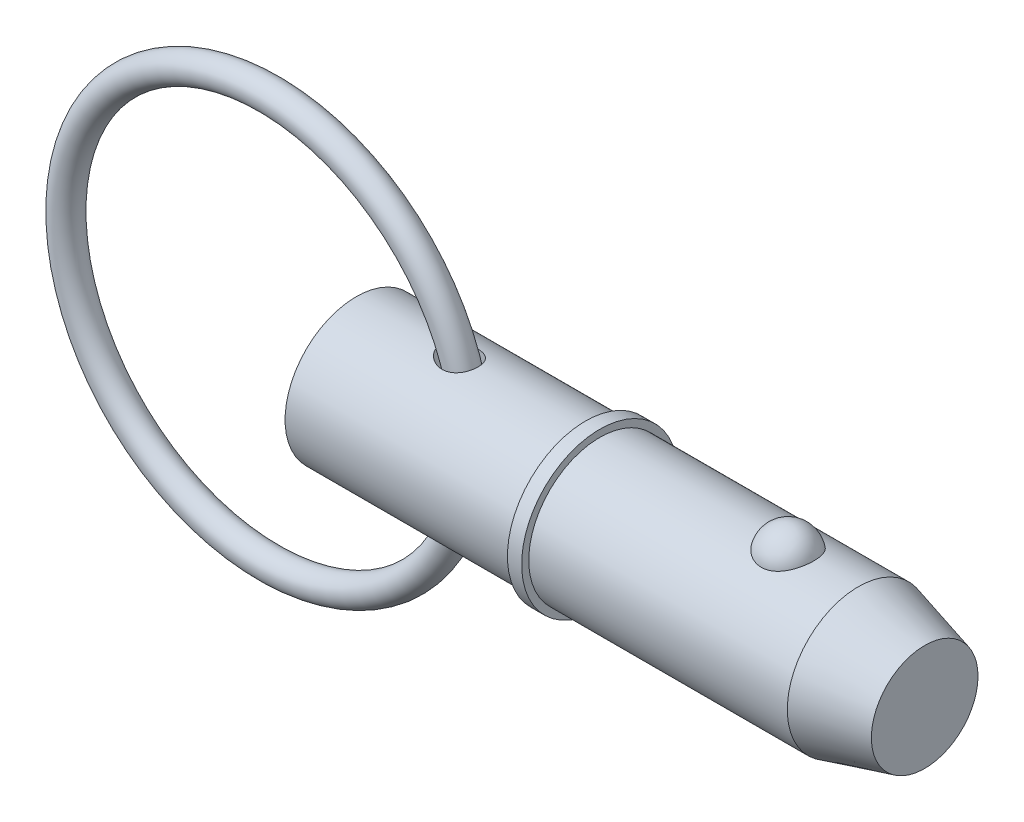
ISO-10303-21;
HEADER;
FILE_DESCRIPTION(('STEP AP214'),'2;1');
FILE_NAME('part.step','',(''),(''),'','','');
FILE_SCHEMA(('AUTOMOTIVE_DESIGN { 1 0 10303 214 1 1 1 1 }'));
ENDSEC;
DATA;
#1=APPLICATION_CONTEXT('core data for automotive mechanical design processes');
#2=APPLICATION_PROTOCOL_DEFINITION('international standard','automotive_design',2000,#1);
#3=PRODUCT_CONTEXT('',#1,'mechanical');
#4=PRODUCT('Part','Part','',(#3));
#5=PRODUCT_RELATED_PRODUCT_CATEGORY('part','',(#4));
#6=PRODUCT_DEFINITION_FORMATION('','',#4);
#7=PRODUCT_DEFINITION_CONTEXT('part definition',#1,'design');
#8=PRODUCT_DEFINITION('design','',#6,#7);
#9=PRODUCT_DEFINITION_SHAPE('','',#8);
#10=(LENGTH_UNIT() NAMED_UNIT(*) SI_UNIT(.MILLI.,.METRE.));
#11=(NAMED_UNIT(*) PLANE_ANGLE_UNIT() SI_UNIT($,.RADIAN.));
#12=(NAMED_UNIT(*) SI_UNIT($,.STERADIAN.) SOLID_ANGLE_UNIT());
#13=UNCERTAINTY_MEASURE_WITH_UNIT(LENGTH_MEASURE(1.E-05),#10,'distance_accuracy_value','');
#14=(GEOMETRIC_REPRESENTATION_CONTEXT(3) GLOBAL_UNCERTAINTY_ASSIGNED_CONTEXT((#13)) GLOBAL_UNIT_ASSIGNED_CONTEXT((#10,
#11,#12)) REPRESENTATION_CONTEXT('',''));
#15=CARTESIAN_POINT('',(0.,0.,0.));
#16=DIRECTION('',(0.,0.,1.));
#17=DIRECTION('',(1.,0.,0.));
#18=AXIS2_PLACEMENT_3D('',#15,#16,#17);
#19=CARTESIAN_POINT('',(-13.640845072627,0.,0.));
#20=DIRECTION('',(0.,0.,1.));
#21=DIRECTION('',(1.,0.,0.));
#22=AXIS2_PLACEMENT_3D('',#19,#20,#21);
#23=TOROIDAL_SURFACE('',#22,31.75,2.223);
#24=CARTESIAN_POINT('',(20.332154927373,0.,0.));
#25=VERTEX_POINT('',#24);
#26=VERTEX_LOOP('',#25);
#27=FACE_BOUND('',#26,.T.);
#28=ADVANCED_FACE('P0_F12',(#27),#23,.T.);
#29=CLOSED_SHELL('',(#28));
#30=MANIFOLD_SOLID_BREP('P0_B1',#29);
#31=CARTESIAN_POINT('',(0.,0.,0.));
#32=DIRECTION('',(1.,0.,0.));
#33=DIRECTION('',(0.,0.,-1.));
#34=AXIS2_PLACEMENT_3D('',#31,#32,#33);
#35=CYLINDRICAL_SURFACE('',#34,11.115);
#36=CARTESIAN_POINT('',(13.5245830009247,11.0328953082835,-1.34849772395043));
#37=CARTESIAN_POINT('',(13.6190616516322,11.0150940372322,-1.49413162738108));
#38=CARTESIAN_POINT('',(13.7272589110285,10.9954577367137,-1.63076546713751));
#39=CARTESIAN_POINT('',(13.9654537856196,10.9550099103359,-1.8834727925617));
#40=CARTESIAN_POINT('',(14.0954990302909,10.9341958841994,-1.99950019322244));
#41=CARTESIAN_POINT('',(14.3718600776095,10.893854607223,-2.20871939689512));
#42=CARTESIAN_POINT('',(14.5180879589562,10.8743212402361,-2.30202655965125));
#43=CARTESIAN_POINT('',(14.8233821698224,10.8385071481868,-2.46515115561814));
#44=CARTESIAN_POINT('',(14.9824448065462,10.8222254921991,-2.53497531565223));
#45=CARTESIAN_POINT('',(15.3233581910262,10.7936101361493,-2.65430007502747));
#46=CARTESIAN_POINT('',(15.5060064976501,10.7817126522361,-2.7016502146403));
#47=CARTESIAN_POINT('',(15.8771124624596,10.7657570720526,-2.76455948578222));
#48=CARTESIAN_POINT('',(16.0655695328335,10.7616981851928,-2.78012182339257));
#49=CARTESIAN_POINT('',(16.4345152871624,10.7624400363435,-2.77724928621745));
#50=CARTESIAN_POINT('',(16.6150121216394,10.7668823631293,-2.76018977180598));
#51=CARTESIAN_POINT('',(16.9695132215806,10.7837407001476,-2.69357457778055));
#52=CARTESIAN_POINT('',(17.1435222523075,10.7961507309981,-2.64404326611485));
#53=CARTESIAN_POINT('',(17.4621418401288,10.8258984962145,-2.51928348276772));
#54=CARTESIAN_POINT('',(17.6079677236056,10.8426430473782,-2.44700611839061));
#55=CARTESIAN_POINT('',(17.884162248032,10.8794194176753,-2.27791740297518));
#56=CARTESIAN_POINT('',(18.0145349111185,10.8994503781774,-2.18111245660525));
#57=CARTESIAN_POINT('',(18.2494965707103,10.9392822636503,-1.9713196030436));
#58=CARTESIAN_POINT('',(18.3550661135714,10.9590421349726,-1.85941863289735));
#59=CARTESIAN_POINT('',(18.5458147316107,10.9970986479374,-1.61919918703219));
#60=CARTESIAN_POINT('',(18.6309947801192,11.0153953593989,-1.49088149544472));
#61=CARTESIAN_POINT('',(18.7786686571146,11.0484675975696,-1.2218388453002));
#62=CARTESIAN_POINT('',(18.8412214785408,11.063252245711,-1.08114735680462));
#63=CARTESIAN_POINT('',(18.9425265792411,11.0877718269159,-0.791025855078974));
#64=CARTESIAN_POINT('',(18.9812780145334,11.0975065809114,-0.641595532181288));
#65=CARTESIAN_POINT('',(19.0343305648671,11.1109435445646,-0.336997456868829));
#66=CARTESIAN_POINT('',(19.0484404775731,11.1145985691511,-0.181794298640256));
#67=CARTESIAN_POINT('',(19.0513147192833,11.1153384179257,0.1288646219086));
#68=CARTESIAN_POINT('',(19.0400783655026,11.112423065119,0.284320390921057));
#69=CARTESIAN_POINT('',(18.9924362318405,11.1003163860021,0.591525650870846));
#70=CARTESIAN_POINT('',(18.9559600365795,11.0911075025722,0.743263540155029));
#71=CARTESIAN_POINT('',(18.858576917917,11.0673920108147,1.03825247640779));
#72=CARTESIAN_POINT('',(18.7976699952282,11.0528854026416,1.18150352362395));
#73=CARTESIAN_POINT('',(18.6529960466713,11.020201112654,1.45511394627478));
#74=CARTESIAN_POINT('',(18.5692772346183,11.0020311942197,1.58549973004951));
#75=CARTESIAN_POINT('',(18.3810003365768,10.9640237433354,1.82995492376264));
#76=CARTESIAN_POINT('',(18.2764441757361,10.9441863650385,1.9440258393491));
#77=CARTESIAN_POINT('',(18.0501398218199,10.9052267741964,2.15183128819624));
#78=CARTESIAN_POINT('',(17.9285270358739,10.8861003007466,2.24571250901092));
#79=CARTESIAN_POINT('',(17.6709592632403,10.8505244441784,2.41175942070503));
#80=CARTESIAN_POINT('',(17.5350055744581,10.8340748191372,2.48392707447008));
#81=CARTESIAN_POINT('',(17.2528390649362,10.8056099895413,2.60497667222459));
#82=CARTESIAN_POINT('',(17.1066353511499,10.7935909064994,2.65387899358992));
#83=CARTESIAN_POINT('',(16.8080326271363,10.7750969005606,2.72799859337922));
#84=CARTESIAN_POINT('',(16.6556326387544,10.7686228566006,2.75321211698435));
#85=CARTESIAN_POINT('',(16.3428877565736,10.761517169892,2.78086153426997));
#86=CARTESIAN_POINT('',(16.1824599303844,10.7611149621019,2.78240297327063));
#87=CARTESIAN_POINT('',(15.863296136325,10.766478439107,2.76156874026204));
#88=CARTESIAN_POINT('',(15.7045607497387,10.7722461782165,2.73918510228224));
#89=CARTESIAN_POINT('',(15.3787211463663,10.7898500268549,2.66904167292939));
#90=CARTESIAN_POINT('',(15.2120794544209,10.8021675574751,2.6192557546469));
#91=CARTESIAN_POINT('',(14.8886284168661,10.8315482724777,2.4949635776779));
#92=CARTESIAN_POINT('',(14.731827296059,10.8486153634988,2.42043695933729));
#93=CARTESIAN_POINT('',(14.4198762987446,10.8870804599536,2.24137362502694));
#94=CARTESIAN_POINT('',(14.2658484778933,10.9087148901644,2.13492229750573));
#95=CARTESIAN_POINT('',(13.9788214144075,10.9526299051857,1.89676517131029));
#96=CARTESIAN_POINT('',(13.845804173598,10.9749099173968,1.76508120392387));
#97=CARTESIAN_POINT('',(13.6310853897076,11.012885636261,1.50762337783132));
#98=CARTESIAN_POINT('',(13.5444453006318,11.0290026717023,1.38602082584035));
#99=CARTESIAN_POINT('',(13.392158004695,11.0581740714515,1.12983363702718));
#100=CARTESIAN_POINT('',(13.3264946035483,11.0712307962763,0.995259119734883));
#101=CARTESIAN_POINT('',(13.2464179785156,11.0874250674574,0.785640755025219));
#102=CARTESIAN_POINT('',(13.2227369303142,11.0922707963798,0.71416661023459));
#103=CARTESIAN_POINT('',(13.1820656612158,11.1006486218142,0.56927708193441));
#104=CARTESIAN_POINT('',(13.1650721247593,11.1041813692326,0.495862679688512));
#105=CARTESIAN_POINT('',(13.1381118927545,11.1098070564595,0.34771199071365));
#106=CARTESIAN_POINT('',(13.1281436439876,11.1119003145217,0.272975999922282));
#107=CARTESIAN_POINT('',(13.1154243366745,11.1145746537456,0.122890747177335));
#108=CARTESIAN_POINT('',(13.1126723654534,11.1151559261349,0.0475415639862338));
#109=CARTESIAN_POINT('',(13.1151602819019,11.1146296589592,-0.160384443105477));
#110=CARTESIAN_POINT('',(13.128061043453,11.111903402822,-0.292944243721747));
#111=CARTESIAN_POINT('',(13.175691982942,11.1019662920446,-0.553751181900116));
#112=CARTESIAN_POINT('',(13.2104121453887,11.094757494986,-0.682000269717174));
#113=CARTESIAN_POINT('',(13.2891255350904,11.0787645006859,-0.901873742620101));
#114=CARTESIAN_POINT('',(13.3290466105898,11.0707438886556,-0.995044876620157));
#115=CARTESIAN_POINT('',(13.4192915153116,11.0529876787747,-1.175992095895));
#116=CARTESIAN_POINT('',(13.4696154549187,11.0432520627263,-1.26376812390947));
#117=CARTESIAN_POINT('',(13.5245830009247,11.0328953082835,-1.34849772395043));
#118=B_SPLINE_CURVE_WITH_KNOTS('',3,(#36,#37,#38,#39,#40,#41,#42,#43,#44,#45,#46,#47,#48,#49,
#50,#51,#52,#53,#54,#55,#56,#57,#58,#59,#60,#61,#62,#63,#64,#65,#66,#67,#68,#69,#70,#71,#72,#73,
#74,#75,#76,#77,#78,#79,#80,#81,#82,#83,#84,#85,#86,#87,#88,#89,#90,#91,#92,#93,#94,#95,#96,#97,
#98,#99,#100,#101,#102,#103,#104,#105,#106,#107,#108,#109,#110,#111,#112,#113,#114,#115,#116,
#117),.UNSPECIFIED.,.T.,.F.,(4,2,2,2,2,2,2,2,2,2,2,2,2,2,2,2,2,2,2,2,2,2,2,2,2,2,2,2,2,2,2,2,2,
2,2,2,2,2,2,2,4),(0.,0.523099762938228,1.04735506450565,1.5688902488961,2.09027590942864,
2.65465173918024,3.21897064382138,3.76002078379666,4.30066536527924,4.78898318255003,
5.27717362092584,5.74028268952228,6.20336964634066,6.66524040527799,7.12712754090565,
7.59258295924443,8.05805091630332,8.52482272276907,8.99159451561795,9.45738731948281,
9.92313710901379,10.3853792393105,10.8475795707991,11.3093743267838,11.771242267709,
12.2505208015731,12.7299589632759,13.2508366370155,13.7721440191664,14.334890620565,
14.8971525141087,15.3459336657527,15.7943675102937,16.0204422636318,16.2464047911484,
16.4723173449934,16.6982013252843,17.095711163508,17.4930386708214,17.7973741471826,
18.1017128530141),.UNSPECIFIED.);
#119=CARTESIAN_POINT('',(13.5245830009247,11.0328953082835,-1.34849772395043));
#120=VERTEX_POINT('',#119);
#121=EDGE_CURVE('P1_E42',#120,#120,#118,.T.);
#122=ORIENTED_EDGE('',*,*,#121,.T.);
#123=EDGE_LOOP('',(#122));
#124=FACE_BOUND('',#123,.T.);
#125=CARTESIAN_POINT('',(0.,0.,0.));
#126=DIRECTION('',(1.,0.,0.));
#127=DIRECTION('',(0.,0.,-1.));
#128=AXIS2_PLACEMENT_3D('',#125,#126,#127);
#129=CIRCLE('',#128,11.115);
#130=CARTESIAN_POINT('',(0.,0.,-11.115));
#131=VERTEX_POINT('',#130);
#132=EDGE_CURVE('P1_E9',#131,#131,#129,.T.);
#133=ORIENTED_EDGE('',*,*,#132,.T.);
#134=EDGE_LOOP('',(#133));
#135=FACE_BOUND('',#134,.T.);
#136=CARTESIAN_POINT('',(35.877,0.,0.));
#137=DIRECTION('',(1.,0.,0.));
#138=DIRECTION('',(0.,0.,-1.));
#139=AXIS2_PLACEMENT_3D('',#136,#137,#138);
#140=CIRCLE('',#139,11.115);
#141=CARTESIAN_POINT('',(35.877,0.,-11.115));
#142=VERTEX_POINT('',#141);
#143=EDGE_CURVE('P1_E25',#142,#142,#140,.T.);
#144=ORIENTED_EDGE('',*,*,#143,.F.);
#145=EDGE_LOOP('',(#144));
#146=FACE_BOUND('',#145,.T.);
#147=CARTESIAN_POINT('',(13.5245830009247,-11.0328953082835,-1.34849772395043));
#148=CARTESIAN_POINT('',(13.449887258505,-11.0469690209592,-1.233356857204));
#149=CARTESIAN_POINT('',(13.3837464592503,-11.0598986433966,-1.11255897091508));
#150=CARTESIAN_POINT('',(13.271526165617,-11.0822620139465,-0.861680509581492));
#151=CARTESIAN_POINT('',(13.2254273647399,-11.0916991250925,-0.731609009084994));
#152=CARTESIAN_POINT('',(13.1557497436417,-11.1060943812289,-0.464578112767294));
#153=CARTESIAN_POINT('',(13.1322820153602,-11.111030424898,-0.327588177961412));
#154=CARTESIAN_POINT('',(13.1098958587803,-11.1157368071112,-0.0515139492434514));
#155=CARTESIAN_POINT('',(13.1109730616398,-11.1155080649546,0.087569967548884));
#156=CARTESIAN_POINT('',(13.1367722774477,-11.110088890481,0.354927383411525));
#157=CARTESIAN_POINT('',(13.160070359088,-11.1051972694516,0.483348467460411));
#158=CARTESIAN_POINT('',(13.2268311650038,-11.091413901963,0.734581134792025));
#159=CARTESIAN_POINT('',(13.2702981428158,-11.0825213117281,0.857391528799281));
#160=CARTESIAN_POINT('',(13.3769008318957,-11.0612491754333,1.09871322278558));
#161=CARTESIAN_POINT('',(13.4406446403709,-11.048763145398,1.21694419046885));
#162=CARTESIAN_POINT('',(13.5844860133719,-11.0215642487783,1.44267020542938));
#163=CARTESIAN_POINT('',(13.6645903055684,-11.0068504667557,1.55016080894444));
#164=CARTESIAN_POINT('',(13.8511803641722,-10.9741237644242,1.76795565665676));
#165=CARTESIAN_POINT('',(13.959808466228,-10.9559422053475,1.87639683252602));
#166=CARTESIAN_POINT('',(14.1916437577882,-10.9197998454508,2.07642617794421));
#167=CARTESIAN_POINT('',(14.3148607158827,-10.901839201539,2.16800294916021));
#168=CARTESIAN_POINT('',(14.5931107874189,-10.8649902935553,2.34622033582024));
#169=CARTESIAN_POINT('',(14.7501095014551,-10.8463937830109,2.42986679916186));
#170=CARTESIAN_POINT('',(15.0757118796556,-10.8136392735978,2.57171975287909));
#171=CARTESIAN_POINT('',(15.2443214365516,-10.7994835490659,2.62991321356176));
#172=CARTESIAN_POINT('',(15.599068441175,-10.7767894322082,2.72147498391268));
#173=CARTESIAN_POINT('',(15.7856559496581,-10.768622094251,2.75321798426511));
#174=CARTESIAN_POINT('',(16.1617095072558,-10.7608206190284,2.78356776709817));
#175=CARTESIAN_POINT('',(16.3511739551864,-10.7611818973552,2.78219235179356));
#176=CARTESIAN_POINT('',(16.7138126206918,-10.7705428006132,2.7457129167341));
#177=CARTESIAN_POINT('',(16.8872269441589,-10.7789612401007,2.71287798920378));
#178=CARTESIAN_POINT('',(17.2247245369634,-10.8028011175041,2.61632772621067));
#179=CARTESIAN_POINT('',(17.3888134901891,-10.8182182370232,2.55263143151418));
#180=CARTESIAN_POINT('',(17.6871641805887,-10.8524191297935,2.40281428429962));
#181=CARTESIAN_POINT('',(17.8227812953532,-10.8707652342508,2.31928155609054));
#182=CARTESIAN_POINT('',(18.0770765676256,-10.9094513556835,2.12988301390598));
#183=CARTESIAN_POINT('',(18.1957578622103,-10.9297910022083,2.02402134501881));
#184=CARTESIAN_POINT('',(18.4088055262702,-10.9693230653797,1.79719870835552));
#185=CARTESIAN_POINT('',(18.5038890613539,-10.9885305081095,1.67691225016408));
#186=CARTESIAN_POINT('',(18.6726701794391,-11.0244347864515,1.42183894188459));
#187=CARTESIAN_POINT('',(18.7463681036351,-11.0411316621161,1.28705232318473));
#188=CARTESIAN_POINT('',(18.8708297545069,-11.0702507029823,1.00634471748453));
#189=CARTESIAN_POINT('',(18.9215212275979,-11.0826593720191,0.860390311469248));
#190=CARTESIAN_POINT('',(18.9984973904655,-11.1017993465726,0.561823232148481));
#191=CARTESIAN_POINT('',(19.0247811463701,-11.1085304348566,0.409210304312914));
#192=CARTESIAN_POINT('',(19.0524622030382,-11.1156244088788,0.100537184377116));
#193=CARTESIAN_POINT('',(19.0536873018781,-11.1159432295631,-0.0555394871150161));
#194=CARTESIAN_POINT('',(19.0307837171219,-11.110065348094,-0.365700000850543));
#195=CARTESIAN_POINT('',(19.0066544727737,-11.1038685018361,-0.519783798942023));
#196=CARTESIAN_POINT('',(18.9335163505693,-11.0856111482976,-0.821817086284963));
#197=CARTESIAN_POINT('',(18.8844701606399,-11.0735418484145,-0.969757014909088));
#198=CARTESIAN_POINT('',(18.7625929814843,-11.0448501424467,-1.25502066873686));
#199=CARTESIAN_POINT('',(18.6897623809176,-11.0282278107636,-1.39234456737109));
#200=CARTESIAN_POINT('',(18.522359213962,-10.9923333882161,-1.65195905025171));
#201=CARTESIAN_POINT('',(18.427863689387,-10.9730707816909,-1.77430060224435));
#202=CARTESIAN_POINT('',(18.2194216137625,-10.9340072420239,-2.00099176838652));
#203=CARTESIAN_POINT('',(18.1054772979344,-10.9142063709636,-2.10534344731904));
#204=CARTESIAN_POINT('',(17.8622613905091,-10.8764452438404,-2.2924289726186));
#205=CARTESIAN_POINT('',(17.7331196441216,-10.8584715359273,-2.3753290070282));
#206=CARTESIAN_POINT('',(17.4625069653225,-10.8261386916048,-2.51860389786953));
#207=CARTESIAN_POINT('',(17.3210365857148,-10.8117793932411,-2.57897976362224));
#208=CARTESIAN_POINT('',(17.0290309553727,-10.7880576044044,-2.67648805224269));
#209=CARTESIAN_POINT('',(16.8784484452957,-10.7787241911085,-2.71348542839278));
#210=CARTESIAN_POINT('',(16.573148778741,-10.7659618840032,-2.7636855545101));
#211=CARTESIAN_POINT('',(16.4184306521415,-10.7625343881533,-2.77688267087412));
#212=CARTESIAN_POINT('',(16.1008073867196,-10.761643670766,-2.78033419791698));
#213=CARTESIAN_POINT('',(15.9378898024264,-10.7644957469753,-2.76937572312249));
#214=CARTESIAN_POINT('',(15.6157286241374,-10.7762062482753,-2.72344300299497));
#215=CARTESIAN_POINT('',(15.4564861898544,-10.7850665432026,-2.68846128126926));
#216=CARTESIAN_POINT('',(15.1305734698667,-10.808737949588,-2.59174021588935));
#217=CARTESIAN_POINT('',(14.9645834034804,-10.8240246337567,-2.52782071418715));
#218=CARTESIAN_POINT('',(14.6448218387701,-10.8585969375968,-2.37491543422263));
#219=CARTESIAN_POINT('',(14.4910653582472,-10.8778873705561,-2.28589943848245));
#220=CARTESIAN_POINT('',(14.1837929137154,-10.920550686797,-2.07312951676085));
#221=CARTESIAN_POINT('',(14.0321999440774,-10.9441390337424,-1.94661563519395));
#222=CARTESIAN_POINT('',(13.756115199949,-10.9902311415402,-1.66673537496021));
#223=CARTESIAN_POINT('',(13.6315733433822,-11.0127368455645,-1.51341958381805));
#224=CARTESIAN_POINT('',(13.5245830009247,-11.0328953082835,-1.34849772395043));
#225=B_SPLINE_CURVE_WITH_KNOTS('',3,(#147,#148,#149,#150,#151,#152,#153,#154,#155,#156,#157,
#158,#159,#160,#161,#162,#163,#164,#165,#166,#167,#168,#169,#170,#171,#172,#173,#174,#175,#176,
#177,#178,#179,#180,#181,#182,#183,#184,#185,#186,#187,#188,#189,#190,#191,#192,#193,#194,#195,
#196,#197,#198,#199,#200,#201,#202,#203,#204,#205,#206,#207,#208,#209,#210,#211,#212,#213,#214,
#215,#216,#217,#218,#219,#220,#221,#222,#223,#224),.UNSPECIFIED.,.T.,.F.,(4,2,2,2,2,2,2,2,2,2,2,
2,2,2,2,2,2,2,2,2,2,2,2,2,2,2,2,2,2,2,2,2,2,2,2,2,2,2,4),(0.,0.413394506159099,
0.826389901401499,1.24140245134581,1.65634113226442,2.04635967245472,2.43646050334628,
2.83958259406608,3.24287078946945,3.70479277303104,4.16702582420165,4.70130512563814,
5.23585761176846,5.80123945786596,6.36631739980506,6.89348344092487,7.42032464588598,
7.8989135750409,8.37741373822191,8.83881993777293,9.30021877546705,9.76305681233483,
10.2259125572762,10.6919479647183,11.1579936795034,11.6247393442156,12.0914773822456,
12.55658073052,13.0216306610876,13.4829619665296,13.9442725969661,14.408224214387,
14.8722856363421,15.3601762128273,15.8482186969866,16.3815107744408,16.9154477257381,
17.5086806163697,18.1008056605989),.UNSPECIFIED.);
#226=CARTESIAN_POINT('',(13.5245830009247,-11.0328953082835,-1.34849772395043));
#227=VERTEX_POINT('',#226);
#228=EDGE_CURVE('P1_E17',#227,#227,#225,.T.);
#229=ORIENTED_EDGE('',*,*,#228,.T.);
#230=EDGE_LOOP('',(#229));
#231=FACE_BOUND('',#230,.T.);
#232=ADVANCED_FACE('P1_F13',(#124,#135,#146,#231),#35,.T.);
#233=CARTESIAN_POINT('',(0.,0.,0.));
#234=DIRECTION('',(1.,0.,0.));
#235=DIRECTION('',(0.,0.,-1.));
#236=AXIS2_PLACEMENT_3D('',#233,#234,#235);
#237=CYLINDRICAL_SURFACE('',#236,11.115);
#238=CARTESIAN_POINT('',(78.5295638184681,0.,0.));
#239=DIRECTION('',(1.,0.,0.));
#240=DIRECTION('',(0.,0.,-1.));
#241=AXIS2_PLACEMENT_3D('',#238,#239,#240);
#242=CIRCLE('',#241,11.115);
#243=CARTESIAN_POINT('',(78.5295638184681,0.,-11.115));
#244=VERTEX_POINT('',#243);
#245=EDGE_CURVE('P1_E99',#244,#244,#242,.T.);
#246=ORIENTED_EDGE('',*,*,#245,.F.);
#247=EDGE_LOOP('',(#246));
#248=FACE_BOUND('',#247,.T.);
#249=CARTESIAN_POINT('',(38.1,0.,0.));
#250=DIRECTION('',(1.,0.,0.));
#251=DIRECTION('',(0.,0.,-1.));
#252=AXIS2_PLACEMENT_3D('',#249,#250,#251);
#253=CIRCLE('',#252,11.115);
#254=CARTESIAN_POINT('',(38.1,0.,-11.115));
#255=VERTEX_POINT('',#254);
#256=EDGE_CURVE('P1_E96',#255,#255,#253,.T.);
#257=ORIENTED_EDGE('',*,*,#256,.T.);
#258=EDGE_LOOP('',(#257));
#259=FACE_BOUND('',#258,.T.);
#260=CARTESIAN_POINT('',(67.5310680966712,10.3028087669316,4.17077409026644));
#261=CARTESIAN_POINT('',(67.3147756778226,10.3028003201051,4.17078240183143));
#262=CARTESIAN_POINT('',(67.0985488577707,10.3098895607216,4.15340593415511));
#263=CARTESIAN_POINT('',(66.6725408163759,10.3373834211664,4.08449540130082));
#264=CARTESIAN_POINT('',(66.4627577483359,10.3577841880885,4.03297121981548));
#265=CARTESIAN_POINT('',(66.0557825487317,10.4095237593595,3.89746513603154));
#266=CARTESIAN_POINT('',(65.8585726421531,10.4408466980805,3.8135302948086));
#267=CARTESIAN_POINT('',(65.4813382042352,10.5110236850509,3.61560339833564));
#268=CARTESIAN_POINT('',(65.3013171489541,10.5498792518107,3.50160528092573));
#269=CARTESIAN_POINT('',(64.9576842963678,10.6322884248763,3.24292464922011));
#270=CARTESIAN_POINT('',(64.7946861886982,10.6759443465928,3.09746040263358));
#271=CARTESIAN_POINT('',(64.4945911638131,10.7625291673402,2.78171925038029));
#272=CARTESIAN_POINT('',(64.3574990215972,10.8054579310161,2.61143778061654));
#273=CARTESIAN_POINT('',(64.1064084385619,10.8881935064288,2.24226695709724));
#274=CARTESIAN_POINT('',(63.9937105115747,10.9277761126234,2.04244123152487));
#275=CARTESIAN_POINT('',(63.8017771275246,10.997484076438,1.62578254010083));
#276=CARTESIAN_POINT('',(63.7225446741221,11.0276085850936,1.40894804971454));
#277=CARTESIAN_POINT('',(63.5983034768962,11.0756732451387,0.961250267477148));
#278=CARTESIAN_POINT('',(63.553760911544,11.0934470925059,0.73023943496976));
#279=CARTESIAN_POINT('',(63.5015695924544,11.1143331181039,0.263439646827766));
#280=CARTESIAN_POINT('',(63.4939200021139,11.1174456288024,0.0276507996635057));
#281=CARTESIAN_POINT('',(63.5156105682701,11.1087161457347,-0.440729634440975));
#282=CARTESIAN_POINT('',(63.5447624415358,11.0969502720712,-0.673331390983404));
#283=CARTESIAN_POINT('',(63.6391432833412,11.0597872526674,-1.12996621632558));
#284=CARTESIAN_POINT('',(63.7043729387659,11.0343898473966,-1.35399912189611));
#285=CARTESIAN_POINT('',(63.8696984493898,10.972515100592,-1.78750286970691));
#286=CARTESIAN_POINT('',(63.9698386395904,10.9360236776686,-1.99695478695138));
#287=CARTESIAN_POINT('',(64.2029408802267,10.8557595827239,-2.39520667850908));
#288=CARTESIAN_POINT('',(64.335905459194,10.8119863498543,-2.58400506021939));
#289=CARTESIAN_POINT('',(64.6324076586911,10.7216733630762,-2.93635726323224));
#290=CARTESIAN_POINT('',(64.7960565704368,10.675123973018,-3.09981510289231));
#291=CARTESIAN_POINT('',(65.1498601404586,10.5846571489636,-3.3959224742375));
#292=CARTESIAN_POINT('',(65.3400123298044,10.5407394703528,-3.5285748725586));
#293=CARTESIAN_POINT('',(65.7375014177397,10.4616690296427,-3.75646057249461));
#294=CARTESIAN_POINT('',(65.9443670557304,10.4263443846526,-3.85245432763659));
#295=CARTESIAN_POINT('',(66.3729541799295,10.3675574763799,-4.00798747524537));
#296=CARTESIAN_POINT('',(66.594670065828,10.344090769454,-4.06754052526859));
#297=CARTESIAN_POINT('',(67.0346695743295,10.3128282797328,-4.14614314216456));
#298=CARTESIAN_POINT('',(67.2525654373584,10.3043040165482,-4.16707833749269));
#299=CARTESIAN_POINT('',(67.68894951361,10.3016771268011,-4.17357158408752));
#300=CARTESIAN_POINT('',(67.9074376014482,10.3075716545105,-4.15913661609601));
#301=CARTESIAN_POINT('',(68.3317442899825,10.3326686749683,-4.09636961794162));
#302=CARTESIAN_POINT('',(68.5377458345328,10.3514555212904,-4.04909574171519));
#303=CARTESIAN_POINT('',(68.9385764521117,10.399818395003,-3.92320197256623));
#304=CARTESIAN_POINT('',(69.1334046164,10.4293952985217,-3.8445795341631));
#305=CARTESIAN_POINT('',(69.5111917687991,10.4969600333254,-3.65612410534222));
#306=CARTESIAN_POINT('',(69.6937974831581,10.5351178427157,-3.54564545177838));
#307=CARTESIAN_POINT('',(70.0382040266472,10.6154999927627,-3.2971803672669));
#308=CARTESIAN_POINT('',(70.200000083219,10.657725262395,-3.15918764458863));
#309=CARTESIAN_POINT('',(70.5069596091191,10.744212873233,-2.85163580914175));
#310=CARTESIAN_POINT('',(70.6508919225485,10.7884718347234,-2.68084605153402));
#311=CARTESIAN_POINT('',(70.9092371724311,10.872374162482,-2.3172186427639));
#312=CARTESIAN_POINT('',(71.0236448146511,10.9120167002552,-2.12437704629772));
#313=CARTESIAN_POINT('',(71.2238739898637,10.9838919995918,-1.71516999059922));
#314=CARTESIAN_POINT('',(71.3086617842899,11.0158465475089,-1.498248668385));
#315=CARTESIAN_POINT('',(71.4426838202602,11.0673523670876,-1.052285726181));
#316=CARTESIAN_POINT('',(71.4919174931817,11.086903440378,-0.823243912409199));
#317=CARTESIAN_POINT('',(71.5538915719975,11.1116323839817,-0.359087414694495));
#318=CARTESIAN_POINT('',(71.5665662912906,11.1167843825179,-0.123962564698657));
#319=CARTESIAN_POINT('',(71.554973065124,11.1121144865,0.345220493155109));
#320=CARTESIAN_POINT('',(71.5307056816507,11.1022928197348,0.579278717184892));
#321=CARTESIAN_POINT('',(71.4459073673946,11.0687504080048,1.03866534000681));
#322=CARTESIAN_POINT('',(71.3855299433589,11.0450885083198,1.26402641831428));
#323=CARTESIAN_POINT('',(71.2298532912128,10.9863185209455,1.70076772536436));
#324=CARTESIAN_POINT('',(71.134551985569,10.9512097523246,1.91214712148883));
#325=CARTESIAN_POINT('',(70.9103974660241,10.8729733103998,2.31608359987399));
#326=CARTESIAN_POINT('',(70.7813806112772,10.8298068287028,2.50854240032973));
#327=CARTESIAN_POINT('',(70.4927327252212,10.7401896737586,2.86808766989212));
#328=CARTESIAN_POINT('',(70.3331022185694,10.6937390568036,3.03517457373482));
#329=CARTESIAN_POINT('',(69.9875341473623,10.6029321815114,3.33857581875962));
#330=CARTESIAN_POINT('',(69.8017089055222,10.5585680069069,3.47501541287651));
#331=CARTESIAN_POINT('',(69.4078750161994,10.4769321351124,3.71390897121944));
#332=CARTESIAN_POINT('',(69.1998635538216,10.439661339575,3.81635861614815));
#333=CARTESIAN_POINT('',(68.7540666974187,10.3749407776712,3.98910631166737));
#334=CARTESIAN_POINT('',(68.5152342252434,10.3482457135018,4.05700929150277));
#335=CARTESIAN_POINT('',(68.0279254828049,10.312188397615,4.14782844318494));
#336=CARTESIAN_POINT('',(67.7794535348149,10.3028184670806,4.17076454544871));
#337=CARTESIAN_POINT('',(67.5310680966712,10.3028087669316,4.17077409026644));
#338=B_SPLINE_CURVE_WITH_KNOTS('',3,(#260,#261,#262,#263,#264,#265,#266,#267,#268,#269,#270,
#271,#272,#273,#274,#275,#276,#277,#278,#279,#280,#281,#282,#283,#284,#285,#286,#287,#288,#289,
#290,#291,#292,#293,#294,#295,#296,#297,#298,#299,#300,#301,#302,#303,#304,#305,#306,#307,#308,
#309,#310,#311,#312,#313,#314,#315,#316,#317,#318,#319,#320,#321,#322,#323,#324,#325,#326,#327,
#328,#329,#330,#331,#332,#333,#334,#335,#336,#337),.UNSPECIFIED.,.T.,.F.,(4,2,2,2,2,2,2,2,2,2,2,
2,2,2,2,2,2,2,2,2,2,2,2,2,2,2,2,2,2,2,2,2,2,2,2,2,2,2,4),(0.,0.647966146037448,1.29574482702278,
1.94258643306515,2.58955857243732,3.25496465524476,3.92049326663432,4.61566368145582,
5.31089647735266,6.01531821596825,6.71972398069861,7.42054043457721,8.12137023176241,
8.82309331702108,9.52487047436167,10.2292439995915,10.9335519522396,11.6223330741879,
12.31085589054,12.96476640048,13.6185478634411,14.252184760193,14.8858731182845,
15.5334360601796,16.1811472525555,16.8611459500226,17.5412664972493,18.2431855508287,
18.9451158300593,19.6483065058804,20.3514864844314,21.0516982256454,21.7519516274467,
22.4556690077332,23.1593743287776,23.860149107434,24.5610129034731,25.3054529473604,
26.0495629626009),.UNSPECIFIED.);
#339=CARTESIAN_POINT('',(67.5310680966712,10.3028087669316,4.17077409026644));
#340=VERTEX_POINT('',#339);
#341=EDGE_CURVE('P1_E34',#340,#340,#338,.T.);
#342=ORIENTED_EDGE('',*,*,#341,.T.);
#343=EDGE_LOOP('',(#342));
#344=FACE_BOUND('',#343,.T.);
#345=ADVANCED_FACE('P1_F46',(#248,#259,#344),#237,.T.);
#346=CARTESIAN_POINT('',(0.,0.,0.));
#347=DIRECTION('',(-1.,0.,0.));
#348=DIRECTION('',(0.,0.,1.));
#349=AXIS2_PLACEMENT_3D('',#346,#347,#348);
#350=PLANE('',#349);
#351=ORIENTED_EDGE('',*,*,#132,.F.);
#352=EDGE_LOOP('',(#351));
#353=FACE_BOUND('',#352,.T.);
#354=ADVANCED_FACE('P1_F15',(#353),#350,.T.);
#355=CARTESIAN_POINT('',(35.877,11.115,0.));
#356=DIRECTION('',(-1.,0.,0.));
#357=DIRECTION('',(0.,0.,1.));
#358=AXIS2_PLACEMENT_3D('',#355,#356,#357);
#359=PLANE('',#358);
#360=ORIENTED_EDGE('',*,*,#143,.T.);
#361=EDGE_LOOP('',(#360));
#362=FACE_BOUND('',#361,.T.);
#363=CARTESIAN_POINT('',(35.877,0.,0.));
#364=DIRECTION('',(1.,0.,0.));
#365=DIRECTION('',(0.,0.,-1.));
#366=AXIS2_PLACEMENT_3D('',#363,#364,#365);
#367=CIRCLE('',#366,12.2265);
#368=CARTESIAN_POINT('',(35.877,0.,-12.2265));
#369=VERTEX_POINT('',#368);
#370=EDGE_CURVE('P1_E30',#369,#369,#367,.T.);
#371=ORIENTED_EDGE('',*,*,#370,.F.);
#372=EDGE_LOOP('',(#371));
#373=FACE_BOUND('',#372,.T.);
#374=ADVANCED_FACE('P1_F81',(#362,#373),#359,.T.);
#375=CARTESIAN_POINT('',(0.,0.,0.));
#376=DIRECTION('',(1.,0.,0.));
#377=DIRECTION('',(0.,0.,-1.));
#378=AXIS2_PLACEMENT_3D('',#375,#376,#377);
#379=CYLINDRICAL_SURFACE('',#378,12.2265);
#380=ORIENTED_EDGE('',*,*,#370,.T.);
#381=EDGE_LOOP('',(#380));
#382=FACE_BOUND('',#381,.T.);
#383=CARTESIAN_POINT('',(38.1,0.,0.));
#384=DIRECTION('',(1.,0.,0.));
#385=DIRECTION('',(0.,0.,-1.));
#386=AXIS2_PLACEMENT_3D('',#383,#384,#385);
#387=CIRCLE('',#386,12.2265);
#388=CARTESIAN_POINT('',(38.1,0.,-12.2265));
#389=VERTEX_POINT('',#388);
#390=EDGE_CURVE('P1_E95',#389,#389,#387,.T.);
#391=ORIENTED_EDGE('',*,*,#390,.F.);
#392=EDGE_LOOP('',(#391));
#393=FACE_BOUND('',#392,.T.);
#394=ADVANCED_FACE('P1_F68',(#382,#393),#379,.T.);
#395=CARTESIAN_POINT('',(38.1,12.2265,0.));
#396=DIRECTION('',(1.,0.,0.));
#397=DIRECTION('',(0.,0.,-1.));
#398=AXIS2_PLACEMENT_3D('',#395,#396,#397);
#399=PLANE('',#398);
#400=ORIENTED_EDGE('',*,*,#390,.T.);
#401=EDGE_LOOP('',(#400));
#402=FACE_BOUND('',#401,.T.);
#403=ORIENTED_EDGE('',*,*,#256,.F.);
#404=EDGE_LOOP('',(#403));
#405=FACE_BOUND('',#404,.T.);
#406=ADVANCED_FACE('P1_F62',(#402,#405),#399,.T.);
#407=CARTESIAN_POINT('',(88.9,0.,0.));
#408=DIRECTION('',(-1.,0.,0.));
#409=DIRECTION('',(0.,0.,1.));
#410=AXIS2_PLACEMENT_3D('',#407,#408,#409);
#411=CONICAL_SURFACE('',#410,8.33625000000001,0.26179938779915);
#412=ORIENTED_EDGE('',*,*,#245,.T.);
#413=EDGE_LOOP('',(#412));
#414=FACE_BOUND('',#413,.T.);
#415=CARTESIAN_POINT('',(88.9,0.,0.));
#416=DIRECTION('',(1.,0.,0.));
#417=DIRECTION('',(0.,0.,-1.));
#418=AXIS2_PLACEMENT_3D('',#415,#416,#417);
#419=CIRCLE('',#418,8.33625000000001);
#420=CARTESIAN_POINT('',(88.9,0.,-8.33625000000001));
#421=VERTEX_POINT('',#420);
#422=EDGE_CURVE('P1_E41',#421,#421,#419,.T.);
#423=ORIENTED_EDGE('',*,*,#422,.F.);
#424=EDGE_LOOP('',(#423));
#425=FACE_BOUND('',#424,.T.);
#426=ADVANCED_FACE('P1_F59',(#414,#425),#411,.T.);
#427=CARTESIAN_POINT('',(88.9,8.33625000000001,0.));
#428=DIRECTION('',(1.,0.,0.));
#429=DIRECTION('',(0.,0.,-1.));
#430=AXIS2_PLACEMENT_3D('',#427,#428,#429);
#431=PLANE('',#430);
#432=ORIENTED_EDGE('',*,*,#422,.T.);
#433=EDGE_LOOP('',(#432));
#434=FACE_BOUND('',#433,.T.);
#435=ADVANCED_FACE('P1_F55',(#434),#431,.T.);
#436=CARTESIAN_POINT('',(67.5310680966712,10.0035,0.));
#437=DIRECTION('',(-1.,0.,0.));
#438=DIRECTION('',(0.,1.,0.));
#439=AXIS2_PLACEMENT_3D('',#436,#437,#438);
#440=SPHERICAL_SURFACE('',#439,4.18149999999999);
#441=ORIENTED_EDGE('',*,*,#341,.F.);
#442=EDGE_LOOP('',(#441));
#443=FACE_BOUND('',#442,.T.);
#444=ADVANCED_FACE('P1_F50',(#443),#440,.T.);
#445=CARTESIAN_POINT('',(-13.640845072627,0.,0.));
#446=DIRECTION('',(0.,0.,1.));
#447=DIRECTION('',(1.,0.,0.));
#448=AXIS2_PLACEMENT_3D('',#445,#446,#447);
#449=TOROIDAL_SURFACE('',#448,31.75,2.77875);
#450=ORIENTED_EDGE('',*,*,#228,.F.);
#451=EDGE_LOOP('',(#450));
#452=FACE_BOUND('',#451,.T.);
#453=ORIENTED_EDGE('',*,*,#121,.F.);
#454=EDGE_LOOP('',(#453));
#455=FACE_BOUND('',#454,.T.);
#456=ADVANCED_FACE('P1_F54',(#452,#455),#449,.F.);
#457=CLOSED_SHELL('',(#232,#345,#354,#374,#394,#406,#426,#435,#444,#456));
#458=MANIFOLD_SOLID_BREP('P1_B1',#457);
#459=ADVANCED_BREP_SHAPE_REPRESENTATION('',(#18,#30,#458),#14);
#460=SHAPE_DEFINITION_REPRESENTATION(#9,#459);
ENDSEC;
END-ISO-10303-21;
